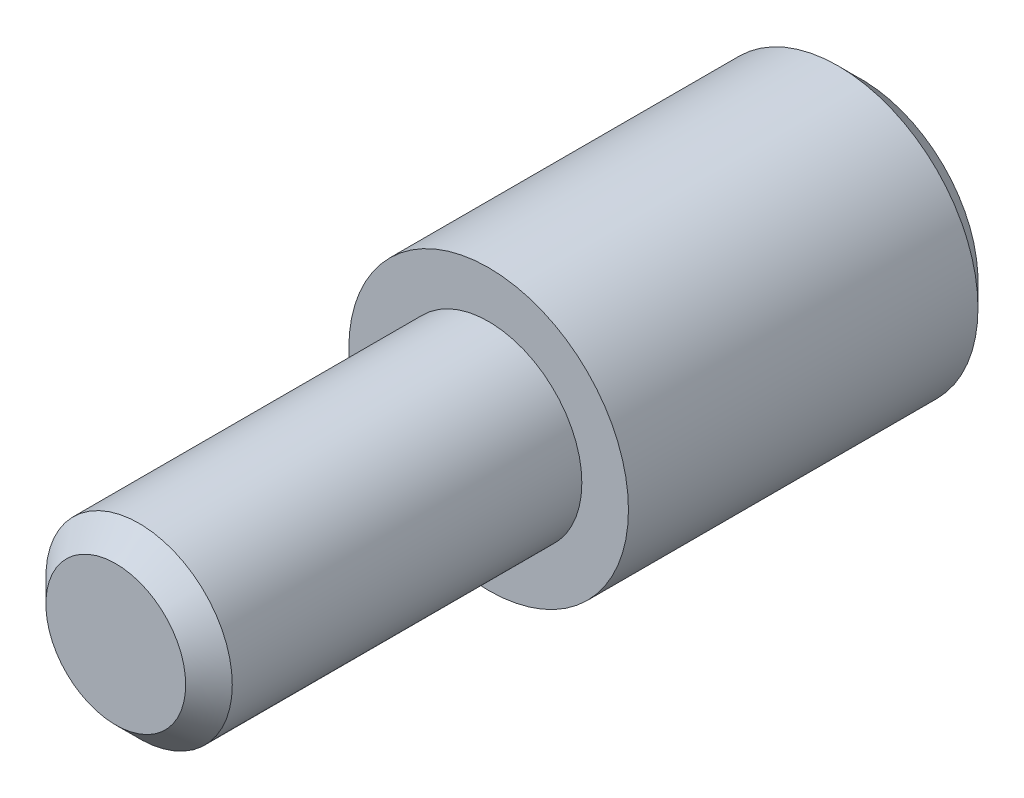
from build123d import *

# Parameters (mm, degrees)
CHANFREIN1_SIZE = 0.5


with BuildPart() as part:
    # Esquisse1 → Base-R_volution (revolve)
    with BuildSketch(Plane(origin=(0, 0, 0), x_dir=(1, 0, 0), z_dir=(0, 1, 0))):
        Polygon((0, 0), (2, 0), (2, 8), (3, 8), (3, 16), (0, 16), align=None)
    revolve(axis=Axis((0, 0, 0), (0, 0, -1)))

    # Chanfrein1
    chanfrein1_edges = [part.edges().sort_by_distance(p)[0] for p in [
        (-2, 0, 0),
        (-3, 0, -16),
    ]]
    chamfer(chanfrein1_edges, length=CHANFREIN1_SIZE)


solid = part.part
